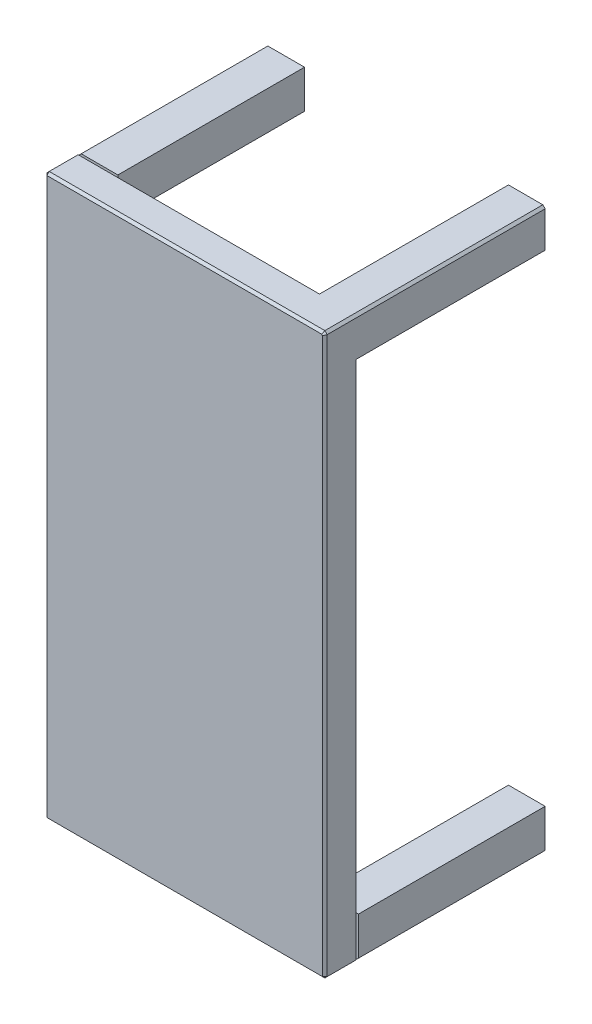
ISO-10303-21;
HEADER;
FILE_DESCRIPTION(('STEP AP214'),'2;1');
FILE_NAME('part.step','',(''),(''),'','','');
FILE_SCHEMA(('AUTOMOTIVE_DESIGN { 1 0 10303 214 1 1 1 1 }'));
ENDSEC;
DATA;
#1=APPLICATION_CONTEXT('core data for automotive mechanical design processes');
#2=APPLICATION_PROTOCOL_DEFINITION('international standard','automotive_design',2000,#1);
#3=PRODUCT_CONTEXT('',#1,'mechanical');
#4=PRODUCT('Part','Part','',(#3));
#5=PRODUCT_RELATED_PRODUCT_CATEGORY('part','',(#4));
#6=PRODUCT_DEFINITION_FORMATION('','',#4);
#7=PRODUCT_DEFINITION_CONTEXT('part definition',#1,'design');
#8=PRODUCT_DEFINITION('design','',#6,#7);
#9=PRODUCT_DEFINITION_SHAPE('','',#8);
#10=(LENGTH_UNIT() NAMED_UNIT(*) SI_UNIT(.MILLI.,.METRE.));
#11=(NAMED_UNIT(*) PLANE_ANGLE_UNIT() SI_UNIT($,.RADIAN.));
#12=(NAMED_UNIT(*) SI_UNIT($,.STERADIAN.) SOLID_ANGLE_UNIT());
#13=UNCERTAINTY_MEASURE_WITH_UNIT(LENGTH_MEASURE(1.E-05),#10,'distance_accuracy_value','');
#14=(GEOMETRIC_REPRESENTATION_CONTEXT(3) GLOBAL_UNCERTAINTY_ASSIGNED_CONTEXT((#13)) GLOBAL_UNIT_ASSIGNED_CONTEXT((#10,
#11,#12)) REPRESENTATION_CONTEXT('',''));
#15=CARTESIAN_POINT('',(0.,0.,0.));
#16=DIRECTION('',(0.,0.,1.));
#17=DIRECTION('',(1.,0.,0.));
#18=AXIS2_PLACEMENT_3D('',#15,#16,#17);
#19=CARTESIAN_POINT('',(0.,0.,0.));
#20=DIRECTION('',(0.,0.,-1.));
#21=DIRECTION('',(-1.,0.,0.));
#22=AXIS2_PLACEMENT_3D('',#19,#20,#21);
#23=PLANE('',#22);
#24=DIRECTION('',(1.,0.,0.));
#25=VECTOR('',#24,1.);
#26=CARTESIAN_POINT('',(0.,-609.6,0.));
#27=LINE('',#26,#25);
#28=CARTESIAN_POINT('',(-302.26,-609.6,0.));
#29=VERTEX_POINT('',#28);
#30=CARTESIAN_POINT('',(-2.53999999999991,-609.6,0.));
#31=VERTEX_POINT('',#30);
#32=EDGE_CURVE('E622',#29,#31,#27,.T.);
#33=ORIENTED_EDGE('',*,*,#32,.F.);
#34=DIRECTION('',(0.707106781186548,-0.707106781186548,0.));
#35=VECTOR('',#34,1.);
#36=CARTESIAN_POINT('',(-455.93,-455.93,0.));
#37=LINE('',#36,#35);
#38=CARTESIAN_POINT('',(-304.8,-607.06,0.));
#39=VERTEX_POINT('',#38);
#40=EDGE_CURVE('E543',#29,#39,#37,.F.);
#41=ORIENTED_EDGE('',*,*,#40,.T.);
#42=DIRECTION('',(0.,-1.,0.));
#43=VECTOR('',#42,1.);
#44=CARTESIAN_POINT('',(-304.8,0.,0.));
#45=LINE('',#44,#43);
#46=CARTESIAN_POINT('',(-304.8,-6.13210244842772,0.));
#47=VERTEX_POINT('',#46);
#48=EDGE_CURVE('E397',#47,#39,#45,.T.);
#49=ORIENTED_EDGE('',*,*,#48,.F.);
#50=DIRECTION('',(0.577350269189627,0.816496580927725,0.));
#51=VECTOR('',#50,1.);
#52=CARTESIAN_POINT('',(-200.309299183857,141.640063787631,0.));
#53=LINE('',#52,#51);
#54=CARTESIAN_POINT('',(-304.047597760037,-5.06804499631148,0.));
#55=VERTEX_POINT('',#54);
#56=EDGE_CURVE('E540',#47,#55,#53,.T.);
#57=ORIENTED_EDGE('',*,*,#56,.T.);
#58=DIRECTION('',(0.,1.,0.));
#59=VECTOR('',#58,1.);
#60=CARTESIAN_POINT('',(-304.047597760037,0.,0.));
#61=LINE('',#60,#59);
#62=CARTESIAN_POINT('',(-304.047597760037,-41.5560271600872,0.));
#63=VERTEX_POINT('',#62);
#64=EDGE_CURVE('E377',#63,#55,#61,.T.);
#65=ORIENTED_EDGE('',*,*,#64,.F.);
#66=DIRECTION('',(-0.707106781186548,0.707106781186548,0.));
#67=VECTOR('',#66,1.);
#68=CARTESIAN_POINT('',(-304.047597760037,-41.5560271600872,0.));
#69=LINE('',#68,#67);
#70=CARTESIAN_POINT('',(-301.507597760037,-44.0960271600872,0.));
#71=VERTEX_POINT('',#70);
#72=EDGE_CURVE('E497',#63,#71,#69,.F.);
#73=ORIENTED_EDGE('',*,*,#72,.T.);
#74=DIRECTION('',(-1.,0.,0.));
#75=VECTOR('',#74,1.);
#76=CARTESIAN_POINT('',(-261.62,-44.0960271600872,0.));
#77=LINE('',#76,#75);
#78=CARTESIAN_POINT('',(-264.16,-44.0960271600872,0.));
#79=VERTEX_POINT('',#78);
#80=EDGE_CURVE('E373',#79,#71,#77,.T.);
#81=ORIENTED_EDGE('',*,*,#80,.F.);
#82=DIRECTION('',(-0.707106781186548,-0.707106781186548,0.));
#83=VECTOR('',#82,1.);
#84=CARTESIAN_POINT('',(-264.16,-44.0960271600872,0.));
#85=LINE('',#84,#83);
#86=CARTESIAN_POINT('',(-261.62,-41.5560271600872,0.));
#87=VERTEX_POINT('',#86);
#88=EDGE_CURVE('E495',#79,#87,#85,.F.);
#89=ORIENTED_EDGE('',*,*,#88,.T.);
#90=DIRECTION('',(0.,-1.,0.));
#91=VECTOR('',#90,1.);
#92=CARTESIAN_POINT('',(-261.62,0.,0.));
#93=LINE('',#92,#91);
#94=CARTESIAN_POINT('',(-261.62,-2.54000000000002,0.));
#95=VERTEX_POINT('',#94);
#96=EDGE_CURVE('E356',#95,#87,#93,.T.);
#97=ORIENTED_EDGE('',*,*,#96,.F.);
#98=DIRECTION('',(1.,0.,0.));
#99=VECTOR('',#98,1.);
#100=CARTESIAN_POINT('',(-42.4275977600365,-2.53999999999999,0.));
#101=LINE('',#100,#99);
#102=CARTESIAN_POINT('',(-42.4275977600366,-2.53999999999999,0.));
#103=VERTEX_POINT('',#102);
#104=EDGE_CURVE('E438',#95,#103,#101,.T.);
#105=ORIENTED_EDGE('',*,*,#104,.T.);
#106=DIRECTION('',(0.,1.,0.));
#107=VECTOR('',#106,1.);
#108=CARTESIAN_POINT('',(-42.4275977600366,0.,0.));
#109=LINE('',#108,#107);
#110=CARTESIAN_POINT('',(-42.4275977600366,-41.5560271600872,0.));
#111=VERTEX_POINT('',#110);
#112=EDGE_CURVE('E388',#111,#103,#109,.T.);
#113=ORIENTED_EDGE('',*,*,#112,.F.);
#114=DIRECTION('',(-0.707106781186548,0.707106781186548,0.));
#115=VECTOR('',#114,1.);
#116=CARTESIAN_POINT('',(-42.4275977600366,-41.5560271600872,0.));
#117=LINE('',#116,#115);
#118=CARTESIAN_POINT('',(-39.8875977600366,-44.0960271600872,0.));
#119=VERTEX_POINT('',#118);
#120=EDGE_CURVE('E441',#111,#119,#117,.F.);
#121=ORIENTED_EDGE('',*,*,#120,.T.);
#122=DIRECTION('',(-1.,0.,0.));
#123=VECTOR('',#122,1.);
#124=CARTESIAN_POINT('',(0.,-44.0960271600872,0.));
#125=LINE('',#124,#123);
#126=CARTESIAN_POINT('',(-2.53999999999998,-44.0960271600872,0.));
#127=VERTEX_POINT('',#126);
#128=EDGE_CURVE('E405',#127,#119,#125,.T.);
#129=ORIENTED_EDGE('',*,*,#128,.F.);
#130=DIRECTION('',(0.,-1.,0.));
#131=VECTOR('',#130,1.);
#132=CARTESIAN_POINT('',(-2.53999999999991,-609.6,0.));
#133=LINE('',#132,#131);
#134=CARTESIAN_POINT('',(-2.53999999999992,-565.15,0.));
#135=VERTEX_POINT('',#134);
#136=EDGE_CURVE('E406',#127,#135,#133,.T.);
#137=ORIENTED_EDGE('',*,*,#136,.T.);
#138=DIRECTION('',(1.,0.,0.));
#139=VECTOR('',#138,1.);
#140=CARTESIAN_POINT('',(0.,-565.15,0.));
#141=LINE('',#140,#139);
#142=CARTESIAN_POINT('',(-39.8875977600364,-565.15,0.));
#143=VERTEX_POINT('',#142);
#144=EDGE_CURVE('E335',#143,#135,#141,.T.);
#145=ORIENTED_EDGE('',*,*,#144,.F.);
#146=DIRECTION('',(0.707106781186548,0.707106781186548,0.));
#147=VECTOR('',#146,1.);
#148=CARTESIAN_POINT('',(-39.8875977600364,-565.15,0.));
#149=LINE('',#148,#147);
#150=CARTESIAN_POINT('',(-42.4275977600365,-567.69,0.));
#151=VERTEX_POINT('',#150);
#152=EDGE_CURVE('E524',#143,#151,#149,.F.);
#153=ORIENTED_EDGE('',*,*,#152,.T.);
#154=DIRECTION('',(0.,1.,0.));
#155=VECTOR('',#154,1.);
#156=CARTESIAN_POINT('',(-42.4275977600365,-565.15,0.));
#157=LINE('',#156,#155);
#158=CARTESIAN_POINT('',(-42.4275977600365,-606.706027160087,0.));
#159=VERTEX_POINT('',#158);
#160=EDGE_CURVE('E349',#159,#151,#157,.T.);
#161=ORIENTED_EDGE('',*,*,#160,.F.);
#162=DIRECTION('',(-0.707106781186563,0.707106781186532,0.));
#163=VECTOR('',#162,1.);
#164=CARTESIAN_POINT('',(-42.4275977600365,-606.706027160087,0.));
#165=LINE('',#164,#163);
#166=CARTESIAN_POINT('',(-39.8875977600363,-609.246027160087,0.));
#167=VERTEX_POINT('',#166);
#168=EDGE_CURVE('E522',#159,#167,#165,.F.);
#169=ORIENTED_EDGE('',*,*,#168,.T.);
#170=DIRECTION('',(-1.,0.,0.));
#171=VECTOR('',#170,1.);
#172=CARTESIAN_POINT('',(0.,-609.246027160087,0.));
#173=LINE('',#172,#171);
#174=CARTESIAN_POINT('',(-2.5399999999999,-609.246027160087,0.));
#175=VERTEX_POINT('',#174);
#176=EDGE_CURVE('E346',#175,#167,#173,.T.);
#177=ORIENTED_EDGE('',*,*,#176,.F.);
#178=EDGE_CURVE('E625',#175,#31,#133,.T.);
#179=ORIENTED_EDGE('',*,*,#178,.T.);
#180=EDGE_LOOP('',(#33,#41,#49,#57,#65,#73,#81,#89,#97,#105,#113,#121,#129,#137,#145,#153,#161,
#169,#177,#179));
#181=FACE_BOUND('',#180,.T.);
#182=DIRECTION('',(-1.,0.,0.));
#183=VECTOR('',#182,1.);
#184=CARTESIAN_POINT('',(-261.62,-609.246027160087,0.));
#185=LINE('',#184,#183);
#186=CARTESIAN_POINT('',(-264.16,-609.246027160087,0.));
#187=VERTEX_POINT('',#186);
#188=CARTESIAN_POINT('',(-301.507597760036,-609.246027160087,0.));
#189=VERTEX_POINT('',#188);
#190=EDGE_CURVE('E326',#187,#189,#185,.T.);
#191=ORIENTED_EDGE('',*,*,#190,.F.);
#192=DIRECTION('',(-0.707106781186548,-0.707106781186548,0.));
#193=VECTOR('',#192,1.);
#194=CARTESIAN_POINT('',(-264.16,-609.246027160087,0.));
#195=LINE('',#194,#193);
#196=CARTESIAN_POINT('',(-261.62,-606.706027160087,0.));
#197=VERTEX_POINT('',#196);
#198=EDGE_CURVE('E465',#187,#197,#195,.F.);
#199=ORIENTED_EDGE('',*,*,#198,.T.);
#200=DIRECTION('',(0.,-1.,0.));
#201=VECTOR('',#200,1.);
#202=CARTESIAN_POINT('',(-261.62,-565.15,0.));
#203=LINE('',#202,#201);
#204=CARTESIAN_POINT('',(-261.62,-565.15,0.));
#205=VERTEX_POINT('',#204);
#206=EDGE_CURVE('E324',#205,#197,#203,.T.);
#207=ORIENTED_EDGE('',*,*,#206,.F.);
#208=DIRECTION('',(1.,0.,0.));
#209=VECTOR('',#208,1.);
#210=CARTESIAN_POINT('',(-261.62,-565.15,0.));
#211=LINE('',#210,#209);
#212=CARTESIAN_POINT('',(-301.507597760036,-565.15,0.));
#213=VERTEX_POINT('',#212);
#214=EDGE_CURVE('E307',#213,#205,#211,.T.);
#215=ORIENTED_EDGE('',*,*,#214,.F.);
#216=DIRECTION('',(0.707106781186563,0.707106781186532,0.));
#217=VECTOR('',#216,1.);
#218=CARTESIAN_POINT('',(-301.507597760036,-565.15,0.));
#219=LINE('',#218,#217);
#220=CARTESIAN_POINT('',(-304.047597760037,-567.69,0.));
#221=VERTEX_POINT('',#220);
#222=EDGE_CURVE('E467',#213,#221,#219,.F.);
#223=ORIENTED_EDGE('',*,*,#222,.T.);
#224=DIRECTION('',(0.,1.,0.));
#225=VECTOR('',#224,1.);
#226=CARTESIAN_POINT('',(-304.047597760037,-565.15,0.));
#227=LINE('',#226,#225);
#228=CARTESIAN_POINT('',(-304.047597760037,-606.706027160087,0.));
#229=VERTEX_POINT('',#228);
#230=EDGE_CURVE('E320',#229,#221,#227,.T.);
#231=ORIENTED_EDGE('',*,*,#230,.F.);
#232=DIRECTION('',(-0.707106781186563,0.707106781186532,0.));
#233=VECTOR('',#232,1.);
#234=CARTESIAN_POINT('',(-304.047597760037,-606.706027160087,0.));
#235=LINE('',#234,#233);
#236=EDGE_CURVE('E469',#229,#189,#235,.F.);
#237=ORIENTED_EDGE('',*,*,#236,.T.);
#238=EDGE_LOOP('',(#191,#199,#207,#215,#223,#231,#237));
#239=FACE_BOUND('',#238,.T.);
#240=ADVANCED_FACE('F31',(#181,#239),#23,.T.);
#241=CARTESIAN_POINT('',(0.,0.,36.576));
#242=DIRECTION('',(-1.,0.,0.));
#243=DIRECTION('',(0.,-1.,0.));
#244=AXIS2_PLACEMENT_3D('',#241,#242,#243);
#245=PLANE('',#244);
#246=DIRECTION('',(0.,-1.,0.));
#247=VECTOR('',#246,1.);
#248=CARTESIAN_POINT('',(0.,0.,34.0359999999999));
#249=LINE('',#248,#247);
#250=CARTESIAN_POINT('',(0.,-2.5400000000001,34.0359999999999));
#251=VERTEX_POINT('',#250);
#252=CARTESIAN_POINT('',(0.,-607.06,34.0359999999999));
#253=VERTEX_POINT('',#252);
#254=EDGE_CURVE('E526',#251,#253,#249,.T.);
#255=ORIENTED_EDGE('',*,*,#254,.T.);
#256=DIRECTION('',(0.,0.,-1.));
#257=VECTOR('',#256,1.);
#258=CARTESIAN_POINT('',(0.,-607.06,36.576));
#259=LINE('',#258,#257);
#260=CARTESIAN_POINT('',(0.,-607.06,2.53999999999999));
#261=VERTEX_POINT('',#260);
#262=EDGE_CURVE('E528',#253,#261,#259,.T.);
#263=ORIENTED_EDGE('',*,*,#262,.T.);
#264=DIRECTION('',(0.,1.,0.));
#265=VECTOR('',#264,1.);
#266=CARTESIAN_POINT('',(0.,-44.0960271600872,2.53999999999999));
#267=LINE('',#266,#265);
#268=CARTESIAN_POINT('',(0.,-41.5560271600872,2.53999999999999));
#269=VERTEX_POINT('',#268);
#270=EDGE_CURVE('E623',#261,#269,#267,.T.);
#271=ORIENTED_EDGE('',*,*,#270,.T.);
#272=DIRECTION('',(0.,0.,-1.));
#273=VECTOR('',#272,1.);
#274=CARTESIAN_POINT('',(0.,-41.5560271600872,36.576));
#275=LINE('',#274,#273);
#276=CARTESIAN_POINT('',(0.,-41.5560271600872,-202.946));
#277=VERTEX_POINT('',#276);
#278=EDGE_CURVE('E429',#269,#277,#275,.T.);
#279=ORIENTED_EDGE('',*,*,#278,.T.);
#280=DIRECTION('',(0.,-1.,0.));
#281=VECTOR('',#280,1.);
#282=CARTESIAN_POINT('',(0.,0.,-202.946));
#283=LINE('',#282,#281);
#284=CARTESIAN_POINT('',(0.,-2.5400000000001,-202.946));
#285=VERTEX_POINT('',#284);
#286=EDGE_CURVE('E384',#285,#277,#283,.T.);
#287=ORIENTED_EDGE('',*,*,#286,.F.);
#288=DIRECTION('',(0.,0.,1.));
#289=VECTOR('',#288,1.);
#290=CARTESIAN_POINT('',(0.,-2.5400000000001,36.576));
#291=LINE('',#290,#289);
#292=EDGE_CURVE('E426',#285,#251,#291,.T.);
#293=ORIENTED_EDGE('',*,*,#292,.T.);
#294=EDGE_LOOP('',(#255,#263,#271,#279,#287,#293));
#295=FACE_BOUND('',#294,.T.);
#296=ADVANCED_FACE('F668',(#295),#245,.F.);
#297=CARTESIAN_POINT('',(0.,0.,36.576));
#298=DIRECTION('',(0.,-1.,0.));
#299=DIRECTION('',(1.,0.,0.));
#300=AXIS2_PLACEMENT_3D('',#297,#298,#299);
#301=PLANE('',#300);
#302=DIRECTION('',(0.,0.,1.));
#303=VECTOR('',#302,1.);
#304=CARTESIAN_POINT('',(-302.26,0.,36.576));
#305=LINE('',#304,#303);
#306=CARTESIAN_POINT('',(-302.26,0.,2.53999999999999));
#307=VERTEX_POINT('',#306);
#308=CARTESIAN_POINT('',(-302.26,0.,34.0359999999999));
#309=VERTEX_POINT('',#308);
#310=EDGE_CURVE('E54',#307,#309,#305,.T.);
#311=ORIENTED_EDGE('',*,*,#310,.T.);
#312=DIRECTION('',(1.,0.,0.));
#313=VECTOR('',#312,1.);
#314=CARTESIAN_POINT('',(0.,0.,34.0359999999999));
#315=LINE('',#314,#313);
#316=CARTESIAN_POINT('',(-2.5400000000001,0.,34.0359999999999));
#317=VERTEX_POINT('',#316);
#318=EDGE_CURVE('E567',#309,#317,#315,.T.);
#319=ORIENTED_EDGE('',*,*,#318,.T.);
#320=DIRECTION('',(0.,0.,-1.));
#321=VECTOR('',#320,1.);
#322=CARTESIAN_POINT('',(-2.5400000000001,0.,36.576));
#323=LINE('',#322,#321);
#324=CARTESIAN_POINT('',(-2.54000000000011,0.,-202.946));
#325=VERTEX_POINT('',#324);
#326=EDGE_CURVE('E436',#317,#325,#323,.T.);
#327=ORIENTED_EDGE('',*,*,#326,.T.);
#328=DIRECTION('',(1.,0.,0.));
#329=VECTOR('',#328,1.);
#330=CARTESIAN_POINT('',(0.,0.,-202.946));
#331=LINE('',#330,#329);
#332=CARTESIAN_POINT('',(-39.8875977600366,0.,-202.946));
#333=VERTEX_POINT('',#332);
#334=EDGE_CURVE('E394',#333,#325,#331,.T.);
#335=ORIENTED_EDGE('',*,*,#334,.F.);
#336=DIRECTION('',(0.,0.,1.));
#337=VECTOR('',#336,1.);
#338=CARTESIAN_POINT('',(-39.8875977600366,0.,36.576));
#339=LINE('',#338,#337);
#340=CARTESIAN_POINT('',(-39.8875977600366,0.,2.53999999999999));
#341=VERTEX_POINT('',#340);
#342=EDGE_CURVE('E433',#333,#341,#339,.T.);
#343=ORIENTED_EDGE('',*,*,#342,.T.);
#344=DIRECTION('',(-1.,0.,0.));
#345=VECTOR('',#344,1.);
#346=CARTESIAN_POINT('',(-304.8,0.,2.53999999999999));
#347=LINE('',#346,#345);
#348=EDGE_CURVE('E431',#341,#307,#347,.T.);
#349=ORIENTED_EDGE('',*,*,#348,.T.);
#350=EDGE_LOOP('',(#311,#319,#327,#335,#343,#349));
#351=FACE_BOUND('',#350,.T.);
#352=ADVANCED_FACE('F660',(#351),#301,.F.);
#353=CARTESIAN_POINT('',(-304.8,0.,36.576));
#354=DIRECTION('',(1.,0.,0.));
#355=DIRECTION('',(0.,1.,0.));
#356=AXIS2_PLACEMENT_3D('',#353,#354,#355);
#357=PLANE('',#356);
#358=ORIENTED_EDGE('',*,*,#48,.T.);
#359=DIRECTION('',(0.,0.,1.));
#360=VECTOR('',#359,1.);
#361=CARTESIAN_POINT('',(-304.8,-607.06,36.576));
#362=LINE('',#361,#360);
#363=CARTESIAN_POINT('',(-304.8,-607.06,34.0359999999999));
#364=VERTEX_POINT('',#363);
#365=EDGE_CURVE('E551',#39,#364,#362,.T.);
#366=ORIENTED_EDGE('',*,*,#365,.T.);
#367=DIRECTION('',(0.,1.,0.));
#368=VECTOR('',#367,1.);
#369=CARTESIAN_POINT('',(-304.8,0.,34.0359999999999));
#370=LINE('',#369,#368);
#371=CARTESIAN_POINT('',(-304.8,-2.54000000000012,34.0359999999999));
#372=VERTEX_POINT('',#371);
#373=EDGE_CURVE('E549',#364,#372,#370,.T.);
#374=ORIENTED_EDGE('',*,*,#373,.T.);
#375=DIRECTION('',(0.,0.,-1.));
#376=VECTOR('',#375,1.);
#377=CARTESIAN_POINT('',(-304.8,-2.54000000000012,36.576));
#378=LINE('',#377,#376);
#379=CARTESIAN_POINT('',(-304.8,-2.54000000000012,3.59210244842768));
#380=VERTEX_POINT('',#379);
#381=EDGE_CURVE('E547',#372,#380,#378,.T.);
#382=ORIENTED_EDGE('',*,*,#381,.T.);
#383=DIRECTION('',(0.,-0.707106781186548,-0.707106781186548));
#384=VECTOR('',#383,1.);
#385=CARTESIAN_POINT('',(-304.8,-4.33605122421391,1.79605122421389));
#386=LINE('',#385,#384);
#387=EDGE_CURVE('E545',#380,#47,#386,.T.);
#388=ORIENTED_EDGE('',*,*,#387,.T.);
#389=EDGE_LOOP('',(#358,#366,#374,#382,#388));
#390=FACE_BOUND('',#389,.T.);
#391=ADVANCED_FACE('F615',(#390),#357,.F.);
#392=CARTESIAN_POINT('',(0.,-609.6,36.576));
#393=DIRECTION('',(0.,1.,0.));
#394=DIRECTION('',(0.,0.,1.));
#395=AXIS2_PLACEMENT_3D('',#392,#393,#394);
#396=PLANE('',#395);
#397=ORIENTED_EDGE('',*,*,#32,.T.);
#398=DIRECTION('',(0.,0.,1.));
#399=VECTOR('',#398,1.);
#400=CARTESIAN_POINT('',(-2.54000000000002,-609.6,36.576));
#401=LINE('',#400,#399);
#402=CARTESIAN_POINT('',(-2.54000000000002,-609.6,34.0359999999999));
#403=VERTEX_POINT('',#402);
#404=EDGE_CURVE('E538',#31,#403,#401,.T.);
#405=ORIENTED_EDGE('',*,*,#404,.T.);
#406=DIRECTION('',(-1.,0.,0.));
#407=VECTOR('',#406,1.);
#408=CARTESIAN_POINT('',(0.,-609.6,34.0359999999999));
#409=LINE('',#408,#407);
#410=CARTESIAN_POINT('',(-302.26,-609.6,34.0359999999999));
#411=VERTEX_POINT('',#410);
#412=EDGE_CURVE('E534',#403,#411,#409,.T.);
#413=ORIENTED_EDGE('',*,*,#412,.T.);
#414=DIRECTION('',(0.,0.,-1.));
#415=VECTOR('',#414,1.);
#416=CARTESIAN_POINT('',(-302.26,-609.6,36.576));
#417=LINE('',#416,#415);
#418=EDGE_CURVE('E536',#411,#29,#417,.T.);
#419=ORIENTED_EDGE('',*,*,#418,.T.);
#420=EDGE_LOOP('',(#397,#405,#413,#419));
#421=FACE_BOUND('',#420,.T.);
#422=ADVANCED_FACE('F711',(#421),#396,.F.);
#423=CARTESIAN_POINT('',(0.,0.,36.576));
#424=DIRECTION('',(0.,0.,-1.));
#425=DIRECTION('',(-1.,0.,0.));
#426=AXIS2_PLACEMENT_3D('',#423,#424,#425);
#427=PLANE('',#426);
#428=DIRECTION('',(1.,0.,0.));
#429=VECTOR('',#428,1.);
#430=CARTESIAN_POINT('',(0.,-607.06,36.576));
#431=LINE('',#430,#429);
#432=CARTESIAN_POINT('',(-302.26,-607.06,36.576));
#433=VERTEX_POINT('',#432);
#434=CARTESIAN_POINT('',(-2.54000000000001,-607.06,36.576));
#435=VERTEX_POINT('',#434);
#436=EDGE_CURVE('E559',#433,#435,#431,.T.);
#437=ORIENTED_EDGE('',*,*,#436,.T.);
#438=DIRECTION('',(0.,1.,0.));
#439=VECTOR('',#438,1.);
#440=CARTESIAN_POINT('',(-2.54000000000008,0.,36.576));
#441=LINE('',#440,#439);
#442=CARTESIAN_POINT('',(-2.54000000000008,-3.5921024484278,36.576));
#443=VERTEX_POINT('',#442);
#444=EDGE_CURVE('E561',#435,#443,#441,.T.);
#445=ORIENTED_EDGE('',*,*,#444,.T.);
#446=DIRECTION('',(-0.707106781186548,0.707106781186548,0.));
#447=VECTOR('',#446,1.);
#448=CARTESIAN_POINT('',(-4.33605122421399,-1.79605122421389,36.576));
#449=LINE('',#448,#447);
#450=CARTESIAN_POINT('',(-3.59210244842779,-2.54000000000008,36.576));
#451=VERTEX_POINT('',#450);
#452=EDGE_CURVE('E557',#443,#451,#449,.T.);
#453=ORIENTED_EDGE('',*,*,#452,.T.);
#454=DIRECTION('',(-1.,0.,0.));
#455=VECTOR('',#454,1.);
#456=CARTESIAN_POINT('',(0.,-2.54000000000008,36.576));
#457=LINE('',#456,#455);
#458=CARTESIAN_POINT('',(-302.26,-2.54000000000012,36.576));
#459=VERTEX_POINT('',#458);
#460=EDGE_CURVE('E555',#451,#459,#457,.T.);
#461=ORIENTED_EDGE('',*,*,#460,.T.);
#462=DIRECTION('',(0.,-1.,0.));
#463=VECTOR('',#462,1.);
#464=CARTESIAN_POINT('',(-302.26,0.,36.576));
#465=LINE('',#464,#463);
#466=EDGE_CURVE('E553',#459,#433,#465,.T.);
#467=ORIENTED_EDGE('',*,*,#466,.T.);
#468=EDGE_LOOP('',(#437,#445,#453,#461,#467));
#469=FACE_BOUND('',#468,.T.);
#470=ADVANCED_FACE('F709',(#469),#427,.F.);
#471=CARTESIAN_POINT('',(0.,-44.0960271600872,-202.946));
#472=DIRECTION('',(0.,1.,0.));
#473=DIRECTION('',(0.,0.,1.));
#474=AXIS2_PLACEMENT_3D('',#471,#472,#473);
#475=PLANE('',#474);
#476=ORIENTED_EDGE('',*,*,#128,.T.);
#477=DIRECTION('',(0.,0.,-1.));
#478=VECTOR('',#477,1.);
#479=CARTESIAN_POINT('',(-39.8875977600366,-44.0960271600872,-202.946));
#480=LINE('',#479,#478);
#481=CARTESIAN_POINT('',(-39.8875977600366,-44.0960271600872,-202.946));
#482=VERTEX_POINT('',#481);
#483=EDGE_CURVE('E416',#119,#482,#480,.T.);
#484=ORIENTED_EDGE('',*,*,#483,.T.);
#485=DIRECTION('',(-1.,0.,0.));
#486=VECTOR('',#485,1.);
#487=CARTESIAN_POINT('',(0.,-44.0960271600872,-202.946));
#488=LINE('',#487,#486);
#489=CARTESIAN_POINT('',(-2.5400000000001,-44.0960271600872,-202.946));
#490=VERTEX_POINT('',#489);
#491=EDGE_CURVE('E387',#490,#482,#488,.T.);
#492=ORIENTED_EDGE('',*,*,#491,.F.);
#493=DIRECTION('',(0.,0.,1.));
#494=VECTOR('',#493,1.);
#495=CARTESIAN_POINT('',(-2.54000000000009,-44.0960271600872,-202.946));
#496=LINE('',#495,#494);
#497=EDGE_CURVE('E413',#490,#127,#496,.T.);
#498=ORIENTED_EDGE('',*,*,#497,.T.);
#499=EDGE_LOOP('',(#476,#484,#492,#498));
#500=FACE_BOUND('',#499,.T.);
#501=ADVANCED_FACE('F633',(#500),#475,.F.);
#502=CARTESIAN_POINT('',(-42.4275977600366,0.,-202.946));
#503=DIRECTION('',(1.,0.,0.));
#504=DIRECTION('',(0.,0.,-1.));
#505=AXIS2_PLACEMENT_3D('',#502,#503,#504);
#506=PLANE('',#505);
#507=DIRECTION('',(0.,1.,0.));
#508=VECTOR('',#507,1.);
#509=CARTESIAN_POINT('',(-42.4275977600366,0.,-202.946));
#510=LINE('',#509,#508);
#511=CARTESIAN_POINT('',(-42.4275977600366,-41.5560271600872,-202.946));
#512=VERTEX_POINT('',#511);
#513=CARTESIAN_POINT('',(-42.4275977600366,-2.54,-202.946));
#514=VERTEX_POINT('',#513);
#515=EDGE_CURVE('E391',#512,#514,#510,.T.);
#516=ORIENTED_EDGE('',*,*,#515,.F.);
#517=DIRECTION('',(0.,0.,1.));
#518=VECTOR('',#517,1.);
#519=CARTESIAN_POINT('',(-42.4275977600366,-41.5560271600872,-202.946));
#520=LINE('',#519,#518);
#521=EDGE_CURVE('E410',#512,#111,#520,.T.);
#522=ORIENTED_EDGE('',*,*,#521,.T.);
#523=ORIENTED_EDGE('',*,*,#112,.T.);
#524=DIRECTION('',(0.,0.,-1.));
#525=VECTOR('',#524,1.);
#526=CARTESIAN_POINT('',(-42.4275977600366,-2.53999999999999,-202.946));
#527=LINE('',#526,#525);
#528=EDGE_CURVE('E408',#103,#514,#527,.T.);
#529=ORIENTED_EDGE('',*,*,#528,.T.);
#530=EDGE_LOOP('',(#516,#522,#523,#529));
#531=FACE_BOUND('',#530,.T.);
#532=ADVANCED_FACE('F647',(#531),#506,.F.);
#533=CARTESIAN_POINT('',(0.,-44.0960271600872,-202.946));
#534=DIRECTION('',(0.,0.,-1.));
#535=DIRECTION('',(-1.,0.,0.));
#536=AXIS2_PLACEMENT_3D('',#533,#534,#535);
#537=PLANE('',#536);
#538=ORIENTED_EDGE('',*,*,#491,.T.);
#539=DIRECTION('',(0.707106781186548,-0.707106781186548,0.));
#540=VECTOR('',#539,1.);
#541=CARTESIAN_POINT('',(-19.9437988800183,-64.0398260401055,-202.946));
#542=LINE('',#541,#540);
#543=EDGE_CURVE('E424',#482,#512,#542,.F.);
#544=ORIENTED_EDGE('',*,*,#543,.T.);
#545=ORIENTED_EDGE('',*,*,#515,.T.);
#546=DIRECTION('',(-0.707106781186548,-0.707106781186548,0.));
#547=VECTOR('',#546,1.);
#548=CARTESIAN_POINT('',(-41.9918124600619,-2.10421470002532,-202.946));
#549=LINE('',#548,#547);
#550=EDGE_CURVE('E418',#514,#333,#549,.F.);
#551=ORIENTED_EDGE('',*,*,#550,.T.);
#552=ORIENTED_EDGE('',*,*,#334,.T.);
#553=DIRECTION('',(-0.707106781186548,0.707106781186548,0.));
#554=VECTOR('',#553,1.);
#555=CARTESIAN_POINT('',(20.7780135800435,-23.3180135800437,-202.946));
#556=LINE('',#555,#554);
#557=EDGE_CURVE('E420',#325,#285,#556,.F.);
#558=ORIENTED_EDGE('',*,*,#557,.T.);
#559=ORIENTED_EDGE('',*,*,#286,.T.);
#560=DIRECTION('',(0.707106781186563,0.707106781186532,0.));
#561=VECTOR('',#560,1.);
#562=CARTESIAN_POINT('',(-1.26999999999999,-42.8260271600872,-202.946));
#563=LINE('',#562,#561);
#564=EDGE_CURVE('E422',#277,#490,#563,.F.);
#565=ORIENTED_EDGE('',*,*,#564,.T.);
#566=EDGE_LOOP('',(#538,#544,#545,#551,#552,#558,#559,#565));
#567=FACE_BOUND('',#566,.T.);
#568=ADVANCED_FACE('F644',(#567),#537,.T.);
#569=CARTESIAN_POINT('',(0.,0.,2.53999999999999));
#570=DIRECTION('',(0.707106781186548,0.,-0.707106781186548));
#571=DIRECTION('',(-0.707106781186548,0.,-0.707106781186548));
#572=AXIS2_PLACEMENT_3D('',#569,#570,#571);
#573=PLANE('',#572);
#574=ORIENTED_EDGE('',*,*,#270,.F.);
#575=DIRECTION('',(0.577350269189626,0.577350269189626,0.577350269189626));
#576=VECTOR('',#575,1.);
#577=CARTESIAN_POINT('',(202.353333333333,-404.706666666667,204.893333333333));
#578=LINE('',#577,#576);
#579=EDGE_CURVE('E531',#261,#31,#578,.F.);
#580=ORIENTED_EDGE('',*,*,#579,.T.);
#581=ORIENTED_EDGE('',*,*,#178,.F.);
#582=EDGE_CURVE('E1230',#135,#175,#133,.T.);
#583=ORIENTED_EDGE('',*,*,#582,.F.);
#584=ORIENTED_EDGE('',*,*,#136,.F.);
#585=DIRECTION('',(-0.577350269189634,-0.577350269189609,-0.577350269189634));
#586=VECTOR('',#585,1.);
#587=CARTESIAN_POINT('',(-70.1886666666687,-111.744693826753,-67.6486666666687));
#588=LINE('',#587,#586);
#589=EDGE_CURVE('E443',#127,#269,#588,.F.);
#590=ORIENTED_EDGE('',*,*,#589,.T.);
#591=EDGE_LOOP('',(#574,#580,#581,#583,#584,#590));
#592=FACE_BOUND('',#591,.T.);
#593=ADVANCED_FACE('F687',(#592),#573,.T.);
#594=CARTESIAN_POINT('',(-42.4275977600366,-41.5560271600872,-202.946));
#595=DIRECTION('',(0.707106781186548,0.707106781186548,0.));
#596=DIRECTION('',(-0.707106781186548,0.707106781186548,0.));
#597=AXIS2_PLACEMENT_3D('',#594,#595,#596);
#598=PLANE('',#597);
#599=ORIENTED_EDGE('',*,*,#543,.F.);
#600=ORIENTED_EDGE('',*,*,#483,.F.);
#601=ORIENTED_EDGE('',*,*,#120,.F.);
#602=ORIENTED_EDGE('',*,*,#521,.F.);
#603=EDGE_LOOP('',(#599,#600,#601,#602));
#604=FACE_BOUND('',#603,.T.);
#605=ADVANCED_FACE('F640',(#604),#598,.F.);
#606=CARTESIAN_POINT('',(-2.54000000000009,-44.0960271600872,-202.946));
#607=DIRECTION('',(-0.707106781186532,0.707106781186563,0.));
#608=DIRECTION('',(-0.707106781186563,-0.707106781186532,0.));
#609=AXIS2_PLACEMENT_3D('',#606,#607,#608);
#610=PLANE('',#609);
#611=ORIENTED_EDGE('',*,*,#564,.F.);
#612=ORIENTED_EDGE('',*,*,#278,.F.);
#613=ORIENTED_EDGE('',*,*,#589,.F.);
#614=ORIENTED_EDGE('',*,*,#497,.F.);
#615=EDGE_LOOP('',(#611,#612,#613,#614));
#616=FACE_BOUND('',#615,.T.);
#617=ADVANCED_FACE('F692',(#616),#610,.F.);
#618=CARTESIAN_POINT('',(-2.5400000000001,0.,36.576));
#619=DIRECTION('',(-0.707106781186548,-0.707106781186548,0.));
#620=DIRECTION('',(0.707106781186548,-0.707106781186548,0.));
#621=AXIS2_PLACEMENT_3D('',#618,#619,#620);
#622=PLANE('',#621);
#623=ORIENTED_EDGE('',*,*,#326,.F.);
#624=DIRECTION('',(-0.707106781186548,0.707106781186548,0.));
#625=VECTOR('',#624,1.);
#626=CARTESIAN_POINT('',(0.,-2.5400000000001,34.0359999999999));
#627=LINE('',#626,#625);
#628=EDGE_CURVE('E564',#317,#251,#627,.F.);
#629=ORIENTED_EDGE('',*,*,#628,.T.);
#630=ORIENTED_EDGE('',*,*,#292,.F.);
#631=ORIENTED_EDGE('',*,*,#557,.F.);
#632=EDGE_LOOP('',(#623,#629,#630,#631));
#633=FACE_BOUND('',#632,.T.);
#634=ADVANCED_FACE('F671',(#633),#622,.F.);
#635=CARTESIAN_POINT('',(0.,0.,2.53999999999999));
#636=DIRECTION('',(0.,0.707106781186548,-0.707106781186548));
#637=DIRECTION('',(0.,0.707106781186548,0.707106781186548));
#638=AXIS2_PLACEMENT_3D('',#635,#636,#637);
#639=PLANE('',#638);
#640=CARTESIAN_POINT('',(-302.26,-2.54000000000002,0.));
#641=VERTEX_POINT('',#640);
#642=EDGE_CURVE('E439',#641,#95,#101,.T.);
#643=ORIENTED_EDGE('',*,*,#642,.F.);
#644=DIRECTION('',(0.,0.707106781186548,0.707106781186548));
#645=VECTOR('',#644,1.);
#646=CARTESIAN_POINT('',(-302.26,0.,2.53999999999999));
#647=LINE('',#646,#645);
#648=EDGE_CURVE('E40',#641,#307,#647,.T.);
#649=ORIENTED_EDGE('',*,*,#648,.T.);
#650=ORIENTED_EDGE('',*,*,#348,.F.);
#651=DIRECTION('',(0.577350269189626,0.577350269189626,0.577350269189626));
#652=VECTOR('',#651,1.);
#653=CARTESIAN_POINT('',(-28.5422644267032,11.3453333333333,13.8853333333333));
#654=LINE('',#653,#652);
#655=EDGE_CURVE('E383',#103,#341,#654,.T.);
#656=ORIENTED_EDGE('',*,*,#655,.F.);
#657=ORIENTED_EDGE('',*,*,#104,.F.);
#658=EDGE_LOOP('',(#643,#649,#650,#656,#657));
#659=FACE_BOUND('',#658,.T.);
#660=ADVANCED_FACE('F657',(#659),#639,.T.);
#661=CARTESIAN_POINT('',(-39.8875977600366,0.,36.576));
#662=DIRECTION('',(0.707106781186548,-0.707106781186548,0.));
#663=DIRECTION('',(0.707106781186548,0.707106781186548,0.));
#664=AXIS2_PLACEMENT_3D('',#661,#662,#663);
#665=PLANE('',#664);
#666=ORIENTED_EDGE('',*,*,#550,.F.);
#667=ORIENTED_EDGE('',*,*,#528,.F.);
#668=ORIENTED_EDGE('',*,*,#655,.T.);
#669=ORIENTED_EDGE('',*,*,#342,.F.);
#670=EDGE_LOOP('',(#666,#667,#668,#669));
#671=FACE_BOUND('',#670,.T.);
#672=ADVANCED_FACE('F652',(#671),#665,.F.);
#673=CARTESIAN_POINT('',(-261.62,0.,-202.946));
#674=DIRECTION('',(-1.,0.,0.));
#675=DIRECTION('',(0.,0.,1.));
#676=AXIS2_PLACEMENT_3D('',#673,#674,#675);
#677=PLANE('',#676);
#678=ORIENTED_EDGE('',*,*,#96,.T.);
#679=DIRECTION('',(0.,0.,-1.));
#680=VECTOR('',#679,1.);
#681=CARTESIAN_POINT('',(-261.62,-41.5560271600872,-202.946));
#682=LINE('',#681,#680);
#683=CARTESIAN_POINT('',(-261.62,-41.5560271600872,-202.946));
#684=VERTEX_POINT('',#683);
#685=EDGE_CURVE('E476',#87,#684,#682,.T.);
#686=ORIENTED_EDGE('',*,*,#685,.T.);
#687=DIRECTION('',(0.,-1.,0.));
#688=VECTOR('',#687,1.);
#689=CARTESIAN_POINT('',(-261.62,0.,-202.946));
#690=LINE('',#689,#688);
#691=CARTESIAN_POINT('',(-261.62,0.,-202.946));
#692=VERTEX_POINT('',#691);
#693=EDGE_CURVE('E357',#692,#684,#690,.T.);
#694=ORIENTED_EDGE('',*,*,#693,.F.);
#695=DIRECTION('',(0.,0.,1.));
#696=VECTOR('',#695,1.);
#697=CARTESIAN_POINT('',(-261.62,0.,-202.946));
#698=LINE('',#697,#696);
#699=CARTESIAN_POINT('',(-261.62,0.,0.));
#700=VERTEX_POINT('',#699);
#701=EDGE_CURVE('E369',#692,#700,#698,.T.);
#702=ORIENTED_EDGE('',*,*,#701,.T.);
#703=EDGE_CURVE('E370',#700,#95,#93,.T.);
#704=ORIENTED_EDGE('',*,*,#703,.T.);
#705=EDGE_LOOP('',(#678,#686,#694,#702,#704));
#706=FACE_BOUND('',#705,.T.);
#707=ADVANCED_FACE('F728',(#706),#677,.F.);
#708=CARTESIAN_POINT('',(-261.62,-44.0960271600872,-202.946));
#709=DIRECTION('',(0.,1.,0.));
#710=DIRECTION('',(0.,0.,1.));
#711=AXIS2_PLACEMENT_3D('',#708,#709,#710);
#712=PLANE('',#711);
#713=DIRECTION('',(-1.,0.,0.));
#714=VECTOR('',#713,1.);
#715=CARTESIAN_POINT('',(-261.62,-44.0960271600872,-202.946));
#716=LINE('',#715,#714);
#717=CARTESIAN_POINT('',(-264.16,-44.0960271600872,-202.946));
#718=VERTEX_POINT('',#717);
#719=CARTESIAN_POINT('',(-301.507597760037,-44.0960271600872,-202.946));
#720=VERTEX_POINT('',#719);
#721=EDGE_CURVE('E360',#718,#720,#716,.T.);
#722=ORIENTED_EDGE('',*,*,#721,.F.);
#723=DIRECTION('',(0.,0.,1.));
#724=VECTOR('',#723,1.);
#725=CARTESIAN_POINT('',(-264.16,-44.0960271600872,-202.946));
#726=LINE('',#725,#724);
#727=EDGE_CURVE('E473',#718,#79,#726,.T.);
#728=ORIENTED_EDGE('',*,*,#727,.T.);
#729=ORIENTED_EDGE('',*,*,#80,.T.);
#730=DIRECTION('',(0.,0.,-1.));
#731=VECTOR('',#730,1.);
#732=CARTESIAN_POINT('',(-301.507597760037,-44.0960271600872,-202.946));
#733=LINE('',#732,#731);
#734=EDGE_CURVE('E471',#71,#720,#733,.T.);
#735=ORIENTED_EDGE('',*,*,#734,.T.);
#736=EDGE_LOOP('',(#722,#728,#729,#735));
#737=FACE_BOUND('',#736,.T.);
#738=ADVANCED_FACE('F1066',(#737),#712,.F.);
#739=CARTESIAN_POINT('',(-304.047597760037,0.,-202.946));
#740=DIRECTION('',(1.,0.,0.));
#741=DIRECTION('',(0.,0.,-1.));
#742=AXIS2_PLACEMENT_3D('',#739,#740,#741);
#743=PLANE('',#742);
#744=ORIENTED_EDGE('',*,*,#64,.T.);
#745=CARTESIAN_POINT('',(-304.047597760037,-2.54000000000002,0.));
#746=VERTEX_POINT('',#745);
#747=EDGE_CURVE('E376',#55,#746,#61,.T.);
#748=ORIENTED_EDGE('',*,*,#747,.T.);
#749=DIRECTION('',(0.,0.,-1.));
#750=VECTOR('',#749,1.);
#751=CARTESIAN_POINT('',(-304.047597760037,-2.54000000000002,-202.946));
#752=LINE('',#751,#750);
#753=CARTESIAN_POINT('',(-304.047597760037,-2.54000000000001,-202.946));
#754=VERTEX_POINT('',#753);
#755=EDGE_CURVE('E493',#746,#754,#752,.T.);
#756=ORIENTED_EDGE('',*,*,#755,.T.);
#757=DIRECTION('',(0.,1.,0.));
#758=VECTOR('',#757,1.);
#759=CARTESIAN_POINT('',(-304.047597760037,0.,-202.946));
#760=LINE('',#759,#758);
#761=CARTESIAN_POINT('',(-304.047597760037,-41.5560271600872,-202.946));
#762=VERTEX_POINT('',#761);
#763=EDGE_CURVE('E364',#762,#754,#760,.T.);
#764=ORIENTED_EDGE('',*,*,#763,.F.);
#765=DIRECTION('',(0.,0.,1.));
#766=VECTOR('',#765,1.);
#767=CARTESIAN_POINT('',(-304.047597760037,-41.5560271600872,-202.946));
#768=LINE('',#767,#766);
#769=EDGE_CURVE('E490',#762,#63,#768,.T.);
#770=ORIENTED_EDGE('',*,*,#769,.T.);
#771=EDGE_LOOP('',(#744,#748,#756,#764,#770));
#772=FACE_BOUND('',#771,.T.);
#773=ADVANCED_FACE('F1057',(#772),#743,.F.);
#774=CARTESIAN_POINT('',(-261.62,0.,-202.946));
#775=DIRECTION('',(0.,-1.,0.));
#776=DIRECTION('',(0.,0.,-1.));
#777=AXIS2_PLACEMENT_3D('',#774,#775,#776);
#778=PLANE('',#777);
#779=DIRECTION('',(1.,0.,0.));
#780=VECTOR('',#779,1.);
#781=CARTESIAN_POINT('',(-261.62,0.,-202.946));
#782=LINE('',#781,#780);
#783=CARTESIAN_POINT('',(-301.507597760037,0.,-202.946));
#784=VERTEX_POINT('',#783);
#785=EDGE_CURVE('E367',#784,#692,#782,.T.);
#786=ORIENTED_EDGE('',*,*,#785,.F.);
#787=DIRECTION('',(0.,0.,1.));
#788=VECTOR('',#787,1.);
#789=CARTESIAN_POINT('',(-301.507597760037,0.,-202.946));
#790=LINE('',#789,#788);
#791=CARTESIAN_POINT('',(-301.507597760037,0.,0.));
#792=VERTEX_POINT('',#791);
#793=EDGE_CURVE('E484',#784,#792,#790,.T.);
#794=ORIENTED_EDGE('',*,*,#793,.T.);
#795=DIRECTION('',(1.,0.,0.));
#796=VECTOR('',#795,1.);
#797=CARTESIAN_POINT('',(-261.62,0.,0.));
#798=LINE('',#797,#796);
#799=EDGE_CURVE('E361',#792,#700,#798,.T.);
#800=ORIENTED_EDGE('',*,*,#799,.T.);
#801=ORIENTED_EDGE('',*,*,#701,.F.);
#802=EDGE_LOOP('',(#786,#794,#800,#801));
#803=FACE_BOUND('',#802,.T.);
#804=ADVANCED_FACE('F1048',(#803),#778,.F.);
#805=CARTESIAN_POINT('',(-261.62,-44.0960271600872,-202.946));
#806=DIRECTION('',(0.,0.,-1.));
#807=DIRECTION('',(-1.,0.,0.));
#808=AXIS2_PLACEMENT_3D('',#805,#806,#807);
#809=PLANE('',#808);
#810=ORIENTED_EDGE('',*,*,#693,.T.);
#811=DIRECTION('',(0.707106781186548,0.707106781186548,0.));
#812=VECTOR('',#811,1.);
#813=CARTESIAN_POINT('',(-262.89,-42.8260271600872,-202.946));
#814=LINE('',#813,#812);
#815=EDGE_CURVE('E482',#684,#718,#814,.F.);
#816=ORIENTED_EDGE('',*,*,#815,.T.);
#817=ORIENTED_EDGE('',*,*,#721,.T.);
#818=DIRECTION('',(0.707106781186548,-0.707106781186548,0.));
#819=VECTOR('',#818,1.);
#820=CARTESIAN_POINT('',(-281.563798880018,-64.0398260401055,-202.946));
#821=LINE('',#820,#819);
#822=EDGE_CURVE('E478',#720,#762,#821,.F.);
#823=ORIENTED_EDGE('',*,*,#822,.T.);
#824=ORIENTED_EDGE('',*,*,#763,.T.);
#825=DIRECTION('',(-0.707106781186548,-0.707106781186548,0.));
#826=VECTOR('',#825,1.);
#827=CARTESIAN_POINT('',(-303.611812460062,-2.10421470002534,-202.946));
#828=LINE('',#827,#826);
#829=EDGE_CURVE('E480',#754,#784,#828,.F.);
#830=ORIENTED_EDGE('',*,*,#829,.T.);
#831=ORIENTED_EDGE('',*,*,#785,.T.);
#832=EDGE_LOOP('',(#810,#816,#817,#823,#824,#830,#831));
#833=FACE_BOUND('',#832,.T.);
#834=ADVANCED_FACE('F1040',(#833),#809,.T.);
#835=CARTESIAN_POINT('',(-261.62,-44.0960271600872,0.));
#836=DIRECTION('',(0.,0.,-1.));
#837=DIRECTION('',(-1.,0.,0.));
#838=AXIS2_PLACEMENT_3D('',#835,#836,#837);
#839=PLANE('',#838);
#840=ORIENTED_EDGE('',*,*,#799,.F.);
#841=DIRECTION('',(0.707106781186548,0.707106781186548,0.));
#842=VECTOR('',#841,1.);
#843=CARTESIAN_POINT('',(-301.507597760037,0.,0.));
#844=LINE('',#843,#842);
#845=EDGE_CURVE('E487',#792,#746,#844,.F.);
#846=ORIENTED_EDGE('',*,*,#845,.T.);
#847=ORIENTED_EDGE('',*,*,#747,.F.);
#848=DIRECTION('',(0.577350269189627,0.816496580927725,0.));
#849=VECTOR('',#848,1.);
#850=CARTESIAN_POINT('',(-308.303032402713,-11.0861383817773,0.));
#851=LINE('',#850,#849);
#852=EDGE_CURVE('E11',#55,#641,#851,.T.);
#853=ORIENTED_EDGE('',*,*,#852,.T.);
#854=ORIENTED_EDGE('',*,*,#642,.T.);
#855=ORIENTED_EDGE('',*,*,#703,.F.);
#856=EDGE_LOOP('',(#840,#846,#847,#853,#854,#855));
#857=FACE_BOUND('',#856,.T.);
#858=ADVANCED_FACE('F1032',(#857),#839,.F.);
#859=CARTESIAN_POINT('',(0.,-565.15,-202.946));
#860=DIRECTION('',(-1.,0.,0.));
#861=DIRECTION('',(0.,0.,1.));
#862=AXIS2_PLACEMENT_3D('',#859,#860,#861);
#863=PLANE('',#862);
#864=DIRECTION('',(0.,-1.,0.));
#865=VECTOR('',#864,1.);
#866=CARTESIAN_POINT('',(0.,-565.15,0.));
#867=LINE('',#866,#865);
#868=CARTESIAN_POINT('',(0.,-565.15,0.));
#869=VERTEX_POINT('',#868);
#870=CARTESIAN_POINT('',(0.,-606.706027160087,0.));
#871=VERTEX_POINT('',#870);
#872=EDGE_CURVE('E311',#869,#871,#867,.T.);
#873=ORIENTED_EDGE('',*,*,#872,.T.);
#874=DIRECTION('',(0.,0.,-1.));
#875=VECTOR('',#874,1.);
#876=CARTESIAN_POINT('',(0.,-606.706027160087,-202.946));
#877=LINE('',#876,#875);
#878=CARTESIAN_POINT('',(0.,-606.706027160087,-202.946));
#879=VERTEX_POINT('',#878);
#880=EDGE_CURVE('E506',#871,#879,#877,.T.);
#881=ORIENTED_EDGE('',*,*,#880,.T.);
#882=DIRECTION('',(0.,-1.,0.));
#883=VECTOR('',#882,1.);
#884=CARTESIAN_POINT('',(0.,-565.15,-202.946));
#885=LINE('',#884,#883);
#886=CARTESIAN_POINT('',(0.,-565.15,-202.946));
#887=VERTEX_POINT('',#886);
#888=EDGE_CURVE('E331',#887,#879,#885,.T.);
#889=ORIENTED_EDGE('',*,*,#888,.F.);
#890=DIRECTION('',(0.,0.,1.));
#891=VECTOR('',#890,1.);
#892=CARTESIAN_POINT('',(0.,-565.15,-202.946));
#893=LINE('',#892,#891);
#894=EDGE_CURVE('E343',#887,#869,#893,.T.);
#895=ORIENTED_EDGE('',*,*,#894,.T.);
#896=EDGE_LOOP('',(#873,#881,#889,#895));
#897=FACE_BOUND('',#896,.T.);
#898=ADVANCED_FACE('F1024',(#897),#863,.F.);
#899=CARTESIAN_POINT('',(0.,-609.246027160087,-202.946));
#900=DIRECTION('',(0.,1.,0.));
#901=DIRECTION('',(0.,0.,1.));
#902=AXIS2_PLACEMENT_3D('',#899,#900,#901);
#903=PLANE('',#902);
#904=DIRECTION('',(-1.,0.,0.));
#905=VECTOR('',#904,1.);
#906=CARTESIAN_POINT('',(0.,-609.246027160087,-202.946));
#907=LINE('',#906,#905);
#908=CARTESIAN_POINT('',(-2.53999999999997,-609.246027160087,-202.946));
#909=VERTEX_POINT('',#908);
#910=CARTESIAN_POINT('',(-39.8875977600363,-609.246027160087,-202.946));
#911=VERTEX_POINT('',#910);
#912=EDGE_CURVE('E334',#909,#911,#907,.T.);
#913=ORIENTED_EDGE('',*,*,#912,.F.);
#914=DIRECTION('',(0.,0.,1.));
#915=VECTOR('',#914,1.);
#916=CARTESIAN_POINT('',(-2.54000000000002,-609.246027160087,-202.946));
#917=LINE('',#916,#915);
#918=EDGE_CURVE('E501',#909,#175,#917,.T.);
#919=ORIENTED_EDGE('',*,*,#918,.T.);
#920=ORIENTED_EDGE('',*,*,#176,.T.);
#921=DIRECTION('',(0.,0.,-1.));
#922=VECTOR('',#921,1.);
#923=CARTESIAN_POINT('',(-39.8875977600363,-609.246027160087,-202.946));
#924=LINE('',#923,#922);
#925=EDGE_CURVE('E499',#167,#911,#924,.T.);
#926=ORIENTED_EDGE('',*,*,#925,.T.);
#927=EDGE_LOOP('',(#913,#919,#920,#926));
#928=FACE_BOUND('',#927,.T.);
#929=ADVANCED_FACE('F1015',(#928),#903,.F.);
#930=CARTESIAN_POINT('',(-42.4275977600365,-565.15,-202.946));
#931=DIRECTION('',(1.,0.,0.));
#932=DIRECTION('',(0.,0.,-1.));
#933=AXIS2_PLACEMENT_3D('',#930,#931,#932);
#934=PLANE('',#933);
#935=DIRECTION('',(0.,1.,0.));
#936=VECTOR('',#935,1.);
#937=CARTESIAN_POINT('',(-42.4275977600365,-565.15,-202.946));
#938=LINE('',#937,#936);
#939=CARTESIAN_POINT('',(-42.4275977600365,-606.706027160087,-202.946));
#940=VERTEX_POINT('',#939);
#941=CARTESIAN_POINT('',(-42.4275977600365,-567.69,-202.946));
#942=VERTEX_POINT('',#941);
#943=EDGE_CURVE('E338',#940,#942,#938,.T.);
#944=ORIENTED_EDGE('',*,*,#943,.F.);
#945=DIRECTION('',(0.,0.,1.));
#946=VECTOR('',#945,1.);
#947=CARTESIAN_POINT('',(-42.4275977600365,-606.706027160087,-202.946));
#948=LINE('',#947,#946);
#949=EDGE_CURVE('E516',#940,#159,#948,.T.);
#950=ORIENTED_EDGE('',*,*,#949,.T.);
#951=ORIENTED_EDGE('',*,*,#160,.T.);
#952=DIRECTION('',(0.,0.,-1.));
#953=VECTOR('',#952,1.);
#954=CARTESIAN_POINT('',(-42.4275977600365,-567.69,-202.946));
#955=LINE('',#954,#953);
#956=EDGE_CURVE('E514',#151,#942,#955,.T.);
#957=ORIENTED_EDGE('',*,*,#956,.T.);
#958=EDGE_LOOP('',(#944,#950,#951,#957));
#959=FACE_BOUND('',#958,.T.);
#960=ADVANCED_FACE('F1006',(#959),#934,.F.);
#961=CARTESIAN_POINT('',(0.,-565.15,-202.946));
#962=DIRECTION('',(0.,-1.,0.));
#963=DIRECTION('',(0.,0.,-1.));
#964=AXIS2_PLACEMENT_3D('',#961,#962,#963);
#965=PLANE('',#964);
#966=DIRECTION('',(1.,0.,0.));
#967=VECTOR('',#966,1.);
#968=CARTESIAN_POINT('',(0.,-565.15,-202.946));
#969=LINE('',#968,#967);
#970=CARTESIAN_POINT('',(-39.8875977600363,-565.15,-202.946));
#971=VERTEX_POINT('',#970);
#972=EDGE_CURVE('E341',#971,#887,#969,.T.);
#973=ORIENTED_EDGE('',*,*,#972,.F.);
#974=DIRECTION('',(0.,0.,1.));
#975=VECTOR('',#974,1.);
#976=CARTESIAN_POINT('',(-39.8875977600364,-565.15,-202.946));
#977=LINE('',#976,#975);
#978=EDGE_CURVE('E519',#971,#143,#977,.T.);
#979=ORIENTED_EDGE('',*,*,#978,.T.);
#980=ORIENTED_EDGE('',*,*,#144,.T.);
#981=EDGE_CURVE('E352',#135,#869,#141,.T.);
#982=ORIENTED_EDGE('',*,*,#981,.T.);
#983=ORIENTED_EDGE('',*,*,#894,.F.);
#984=EDGE_LOOP('',(#973,#979,#980,#982,#983));
#985=FACE_BOUND('',#984,.T.);
#986=ADVANCED_FACE('F997',(#985),#965,.F.);
#987=CARTESIAN_POINT('',(0.,-609.246027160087,-202.946));
#988=DIRECTION('',(0.,0.,-1.));
#989=DIRECTION('',(-1.,0.,0.));
#990=AXIS2_PLACEMENT_3D('',#987,#988,#989);
#991=PLANE('',#990);
#992=ORIENTED_EDGE('',*,*,#888,.T.);
#993=DIRECTION('',(0.707106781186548,0.707106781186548,0.));
#994=VECTOR('',#993,1.);
#995=CARTESIAN_POINT('',(-1.26999999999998,-607.976027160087,-202.946));
#996=LINE('',#995,#994);
#997=EDGE_CURVE('E512',#879,#909,#996,.F.);
#998=ORIENTED_EDGE('',*,*,#997,.T.);
#999=ORIENTED_EDGE('',*,*,#912,.T.);
#1000=DIRECTION('',(0.707106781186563,-0.707106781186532,0.));
#1001=VECTOR('',#1000,1.);
#1002=CARTESIAN_POINT('',(-19.9437988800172,-629.189826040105,-202.946));
#1003=LINE('',#1002,#1001);
#1004=EDGE_CURVE('E510',#911,#940,#1003,.F.);
#1005=ORIENTED_EDGE('',*,*,#1004,.T.);
#1006=ORIENTED_EDGE('',*,*,#943,.T.);
#1007=DIRECTION('',(-0.707106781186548,-0.707106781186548,0.));
#1008=VECTOR('',#1007,1.);
#1009=CARTESIAN_POINT('',(-41.9918124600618,-567.254214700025,-202.946));
#1010=LINE('',#1009,#1008);
#1011=EDGE_CURVE('E508',#942,#971,#1010,.F.);
#1012=ORIENTED_EDGE('',*,*,#1011,.T.);
#1013=ORIENTED_EDGE('',*,*,#972,.T.);
#1014=EDGE_LOOP('',(#992,#998,#999,#1005,#1006,#1012,#1013));
#1015=FACE_BOUND('',#1014,.T.);
#1016=ADVANCED_FACE('F988',(#1015),#991,.T.);
#1017=CARTESIAN_POINT('',(0.,-609.246027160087,0.));
#1018=DIRECTION('',(0.,0.,-1.));
#1019=DIRECTION('',(-1.,0.,0.));
#1020=AXIS2_PLACEMENT_3D('',#1017,#1018,#1019);
#1021=PLANE('',#1020);
#1022=ORIENTED_EDGE('',*,*,#582,.T.);
#1023=DIRECTION('',(-0.707106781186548,-0.707106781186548,0.));
#1024=VECTOR('',#1023,1.);
#1025=CARTESIAN_POINT('',(-2.54000000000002,-609.246027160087,0.));
#1026=LINE('',#1025,#1024);
#1027=EDGE_CURVE('E504',#175,#871,#1026,.F.);
#1028=ORIENTED_EDGE('',*,*,#1027,.T.);
#1029=ORIENTED_EDGE('',*,*,#872,.F.);
#1030=ORIENTED_EDGE('',*,*,#981,.F.);
#1031=EDGE_LOOP('',(#1022,#1028,#1029,#1030));
#1032=FACE_BOUND('',#1031,.T.);
#1033=ADVANCED_FACE('F980',(#1032),#1021,.F.);
#1034=CARTESIAN_POINT('',(-261.62,-565.15,-202.946));
#1035=DIRECTION('',(-1.,0.,0.));
#1036=DIRECTION('',(0.,0.,1.));
#1037=AXIS2_PLACEMENT_3D('',#1034,#1035,#1036);
#1038=PLANE('',#1037);
#1039=ORIENTED_EDGE('',*,*,#206,.T.);
#1040=DIRECTION('',(0.,0.,-1.));
#1041=VECTOR('',#1040,1.);
#1042=CARTESIAN_POINT('',(-261.62,-606.706027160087,-202.946));
#1043=LINE('',#1042,#1041);
#1044=CARTESIAN_POINT('',(-261.62,-606.706027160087,-202.946));
#1045=VERTEX_POINT('',#1044);
#1046=EDGE_CURVE('E315',#197,#1045,#1043,.T.);
#1047=ORIENTED_EDGE('',*,*,#1046,.T.);
#1048=DIRECTION('',(0.,-1.,0.));
#1049=VECTOR('',#1048,1.);
#1050=CARTESIAN_POINT('',(-261.62,-565.15,-202.946));
#1051=LINE('',#1050,#1049);
#1052=CARTESIAN_POINT('',(-261.62,-565.15,-202.946));
#1053=VERTEX_POINT('',#1052);
#1054=EDGE_CURVE('E293',#1053,#1045,#1051,.T.);
#1055=ORIENTED_EDGE('',*,*,#1054,.F.);
#1056=DIRECTION('',(0.,0.,1.));
#1057=VECTOR('',#1056,1.);
#1058=CARTESIAN_POINT('',(-261.62,-565.15,-202.946));
#1059=LINE('',#1058,#1057);
#1060=EDGE_CURVE('E301',#1053,#205,#1059,.T.);
#1061=ORIENTED_EDGE('',*,*,#1060,.T.);
#1062=EDGE_LOOP('',(#1039,#1047,#1055,#1061));
#1063=FACE_BOUND('',#1062,.T.);
#1064=ADVANCED_FACE('F313',(#1063),#1038,.F.);
#1065=CARTESIAN_POINT('',(-261.62,-609.246027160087,-202.946));
#1066=DIRECTION('',(0.,1.,0.));
#1067=DIRECTION('',(0.,0.,1.));
#1068=AXIS2_PLACEMENT_3D('',#1065,#1066,#1067);
#1069=PLANE('',#1068);
#1070=DIRECTION('',(-1.,0.,0.));
#1071=VECTOR('',#1070,1.);
#1072=CARTESIAN_POINT('',(-261.62,-609.246027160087,-202.946));
#1073=LINE('',#1072,#1071);
#1074=CARTESIAN_POINT('',(-264.16,-609.246027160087,-202.946));
#1075=VERTEX_POINT('',#1074);
#1076=CARTESIAN_POINT('',(-301.507597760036,-609.246027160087,-202.946));
#1077=VERTEX_POINT('',#1076);
#1078=EDGE_CURVE('E316',#1075,#1077,#1073,.T.);
#1079=ORIENTED_EDGE('',*,*,#1078,.F.);
#1080=DIRECTION('',(0.,0.,1.));
#1081=VECTOR('',#1080,1.);
#1082=CARTESIAN_POINT('',(-264.16,-609.246027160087,-202.946));
#1083=LINE('',#1082,#1081);
#1084=EDGE_CURVE('E449',#1075,#187,#1083,.T.);
#1085=ORIENTED_EDGE('',*,*,#1084,.T.);
#1086=ORIENTED_EDGE('',*,*,#190,.T.);
#1087=DIRECTION('',(0.,0.,-1.));
#1088=VECTOR('',#1087,1.);
#1089=CARTESIAN_POINT('',(-301.507597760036,-609.246027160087,-202.946));
#1090=LINE('',#1089,#1088);
#1091=EDGE_CURVE('E446',#189,#1077,#1090,.T.);
#1092=ORIENTED_EDGE('',*,*,#1091,.T.);
#1093=EDGE_LOOP('',(#1079,#1085,#1086,#1092));
#1094=FACE_BOUND('',#1093,.T.);
#1095=ADVANCED_FACE('F963',(#1094),#1069,.F.);
#1096=CARTESIAN_POINT('',(-304.047597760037,-565.15,-202.946));
#1097=DIRECTION('',(1.,0.,0.));
#1098=DIRECTION('',(0.,0.,-1.));
#1099=AXIS2_PLACEMENT_3D('',#1096,#1097,#1098);
#1100=PLANE('',#1099);
#1101=ORIENTED_EDGE('',*,*,#230,.T.);
#1102=DIRECTION('',(0.,0.,-1.));
#1103=VECTOR('',#1102,1.);
#1104=CARTESIAN_POINT('',(-304.047597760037,-567.69,-202.946));
#1105=LINE('',#1104,#1103);
#1106=CARTESIAN_POINT('',(-304.047597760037,-567.69,-202.946));
#1107=VERTEX_POINT('',#1106);
#1108=EDGE_CURVE('E463',#221,#1107,#1105,.T.);
#1109=ORIENTED_EDGE('',*,*,#1108,.T.);
#1110=DIRECTION('',(0.,1.,0.));
#1111=VECTOR('',#1110,1.);
#1112=CARTESIAN_POINT('',(-304.047597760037,-565.15,-202.946));
#1113=LINE('',#1112,#1111);
#1114=CARTESIAN_POINT('',(-304.047597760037,-606.706027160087,-202.946));
#1115=VERTEX_POINT('',#1114);
#1116=EDGE_CURVE('E302',#1115,#1107,#1113,.T.);
#1117=ORIENTED_EDGE('',*,*,#1116,.F.);
#1118=DIRECTION('',(0.,0.,1.));
#1119=VECTOR('',#1118,1.);
#1120=CARTESIAN_POINT('',(-304.047597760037,-606.706027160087,-202.946));
#1121=LINE('',#1120,#1119);
#1122=EDGE_CURVE('E460',#1115,#229,#1121,.T.);
#1123=ORIENTED_EDGE('',*,*,#1122,.T.);
#1124=EDGE_LOOP('',(#1101,#1109,#1117,#1123));
#1125=FACE_BOUND('',#1124,.T.);
#1126=ADVANCED_FACE('F955',(#1125),#1100,.F.);
#1127=CARTESIAN_POINT('',(-261.62,-565.15,-202.946));
#1128=DIRECTION('',(0.,-1.,0.));
#1129=DIRECTION('',(0.,0.,-1.));
#1130=AXIS2_PLACEMENT_3D('',#1127,#1128,#1129);
#1131=PLANE('',#1130);
#1132=DIRECTION('',(1.,0.,0.));
#1133=VECTOR('',#1132,1.);
#1134=CARTESIAN_POINT('',(-261.62,-565.15,-202.946));
#1135=LINE('',#1134,#1133);
#1136=CARTESIAN_POINT('',(-301.507597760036,-565.15,-202.946));
#1137=VERTEX_POINT('',#1136);
#1138=EDGE_CURVE('E289',#1137,#1053,#1135,.T.);
#1139=ORIENTED_EDGE('',*,*,#1138,.F.);
#1140=DIRECTION('',(0.,0.,1.));
#1141=VECTOR('',#1140,1.);
#1142=CARTESIAN_POINT('',(-301.507597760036,-565.15,-202.946));
#1143=LINE('',#1142,#1141);
#1144=EDGE_CURVE('E458',#1137,#213,#1143,.T.);
#1145=ORIENTED_EDGE('',*,*,#1144,.T.);
#1146=ORIENTED_EDGE('',*,*,#214,.T.);
#1147=ORIENTED_EDGE('',*,*,#1060,.F.);
#1148=EDGE_LOOP('',(#1139,#1145,#1146,#1147));
#1149=FACE_BOUND('',#1148,.T.);
#1150=ADVANCED_FACE('F305',(#1149),#1131,.F.);
#1151=CARTESIAN_POINT('',(-261.62,-609.246027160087,-202.946));
#1152=DIRECTION('',(0.,0.,-1.));
#1153=DIRECTION('',(-1.,0.,0.));
#1154=AXIS2_PLACEMENT_3D('',#1151,#1152,#1153);
#1155=PLANE('',#1154);
#1156=ORIENTED_EDGE('',*,*,#1054,.T.);
#1157=DIRECTION('',(0.707106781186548,0.707106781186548,0.));
#1158=VECTOR('',#1157,1.);
#1159=CARTESIAN_POINT('',(-262.89,-607.976027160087,-202.946));
#1160=LINE('',#1159,#1158);
#1161=EDGE_CURVE('E456',#1045,#1075,#1160,.F.);
#1162=ORIENTED_EDGE('',*,*,#1161,.T.);
#1163=ORIENTED_EDGE('',*,*,#1078,.T.);
#1164=DIRECTION('',(0.707106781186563,-0.707106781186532,0.));
#1165=VECTOR('',#1164,1.);
#1166=CARTESIAN_POINT('',(-281.563798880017,-629.189826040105,-202.946));
#1167=LINE('',#1166,#1165);
#1168=EDGE_CURVE('E453',#1077,#1115,#1167,.F.);
#1169=ORIENTED_EDGE('',*,*,#1168,.T.);
#1170=ORIENTED_EDGE('',*,*,#1116,.T.);
#1171=DIRECTION('',(-0.707106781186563,-0.707106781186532,0.));
#1172=VECTOR('',#1171,1.);
#1173=CARTESIAN_POINT('',(-303.611812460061,-567.254214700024,-202.946));
#1174=LINE('',#1173,#1172);
#1175=EDGE_CURVE('E297',#1107,#1137,#1174,.F.);
#1176=ORIENTED_EDGE('',*,*,#1175,.T.);
#1177=ORIENTED_EDGE('',*,*,#1138,.T.);
#1178=EDGE_LOOP('',(#1156,#1162,#1163,#1169,#1170,#1176,#1177));
#1179=FACE_BOUND('',#1178,.T.);
#1180=ADVANCED_FACE('F291',(#1179),#1155,.T.);
#1181=CARTESIAN_POINT('',(-264.16,-609.246027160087,-202.946));
#1182=DIRECTION('',(-0.707106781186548,0.707106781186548,0.));
#1183=DIRECTION('',(-0.707106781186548,-0.707106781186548,0.));
#1184=AXIS2_PLACEMENT_3D('',#1181,#1182,#1183);
#1185=PLANE('',#1184);
#1186=ORIENTED_EDGE('',*,*,#1161,.F.);
#1187=ORIENTED_EDGE('',*,*,#1046,.F.);
#1188=ORIENTED_EDGE('',*,*,#198,.F.);
#1189=ORIENTED_EDGE('',*,*,#1084,.F.);
#1190=EDGE_LOOP('',(#1186,#1187,#1188,#1189));
#1191=FACE_BOUND('',#1190,.T.);
#1192=ADVANCED_FACE('F931',(#1191),#1185,.F.);
#1193=CARTESIAN_POINT('',(-301.507597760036,-565.15,-202.946));
#1194=DIRECTION('',(0.707106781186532,-0.707106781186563,0.));
#1195=DIRECTION('',(0.707106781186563,0.707106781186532,0.));
#1196=AXIS2_PLACEMENT_3D('',#1193,#1194,#1195);
#1197=PLANE('',#1196);
#1198=ORIENTED_EDGE('',*,*,#1175,.F.);
#1199=ORIENTED_EDGE('',*,*,#1108,.F.);
#1200=ORIENTED_EDGE('',*,*,#222,.F.);
#1201=ORIENTED_EDGE('',*,*,#1144,.F.);
#1202=EDGE_LOOP('',(#1198,#1199,#1200,#1201));
#1203=FACE_BOUND('',#1202,.T.);
#1204=ADVANCED_FACE('F921',(#1203),#1197,.F.);
#1205=CARTESIAN_POINT('',(-304.047597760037,-606.706027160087,-202.946));
#1206=DIRECTION('',(0.707106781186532,0.707106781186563,0.));
#1207=DIRECTION('',(-0.707106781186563,0.707106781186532,0.));
#1208=AXIS2_PLACEMENT_3D('',#1205,#1206,#1207);
#1209=PLANE('',#1208);
#1210=ORIENTED_EDGE('',*,*,#1168,.F.);
#1211=ORIENTED_EDGE('',*,*,#1091,.F.);
#1212=ORIENTED_EDGE('',*,*,#236,.F.);
#1213=ORIENTED_EDGE('',*,*,#1122,.F.);
#1214=EDGE_LOOP('',(#1210,#1211,#1212,#1213));
#1215=FACE_BOUND('',#1214,.T.);
#1216=ADVANCED_FACE('F911',(#1215),#1209,.F.);
#1217=CARTESIAN_POINT('',(-264.16,-44.0960271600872,-202.946));
#1218=DIRECTION('',(-0.707106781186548,0.707106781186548,0.));
#1219=DIRECTION('',(-0.707106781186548,-0.707106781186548,0.));
#1220=AXIS2_PLACEMENT_3D('',#1217,#1218,#1219);
#1221=PLANE('',#1220);
#1222=ORIENTED_EDGE('',*,*,#815,.F.);
#1223=ORIENTED_EDGE('',*,*,#685,.F.);
#1224=ORIENTED_EDGE('',*,*,#88,.F.);
#1225=ORIENTED_EDGE('',*,*,#727,.F.);
#1226=EDGE_LOOP('',(#1222,#1223,#1224,#1225));
#1227=FACE_BOUND('',#1226,.T.);
#1228=ADVANCED_FACE('F902',(#1227),#1221,.F.);
#1229=CARTESIAN_POINT('',(-301.507597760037,0.,-202.946));
#1230=DIRECTION('',(0.707106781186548,-0.707106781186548,0.));
#1231=DIRECTION('',(0.707106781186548,0.707106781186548,0.));
#1232=AXIS2_PLACEMENT_3D('',#1229,#1230,#1231);
#1233=PLANE('',#1232);
#1234=ORIENTED_EDGE('',*,*,#829,.F.);
#1235=ORIENTED_EDGE('',*,*,#755,.F.);
#1236=ORIENTED_EDGE('',*,*,#845,.F.);
#1237=ORIENTED_EDGE('',*,*,#793,.F.);
#1238=EDGE_LOOP('',(#1234,#1235,#1236,#1237));
#1239=FACE_BOUND('',#1238,.T.);
#1240=ADVANCED_FACE('F892',(#1239),#1233,.F.);
#1241=CARTESIAN_POINT('',(-304.047597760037,-41.5560271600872,-202.946));
#1242=DIRECTION('',(0.707106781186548,0.707106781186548,0.));
#1243=DIRECTION('',(-0.707106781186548,0.707106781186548,0.));
#1244=AXIS2_PLACEMENT_3D('',#1241,#1242,#1243);
#1245=PLANE('',#1244);
#1246=ORIENTED_EDGE('',*,*,#822,.F.);
#1247=ORIENTED_EDGE('',*,*,#734,.F.);
#1248=ORIENTED_EDGE('',*,*,#72,.F.);
#1249=ORIENTED_EDGE('',*,*,#769,.F.);
#1250=EDGE_LOOP('',(#1246,#1247,#1248,#1249));
#1251=FACE_BOUND('',#1250,.T.);
#1252=ADVANCED_FACE('F883',(#1251),#1245,.F.);
#1253=CARTESIAN_POINT('',(-2.54000000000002,-609.246027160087,-202.946));
#1254=DIRECTION('',(-0.707106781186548,0.707106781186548,0.));
#1255=DIRECTION('',(-0.707106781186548,-0.707106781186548,0.));
#1256=AXIS2_PLACEMENT_3D('',#1253,#1254,#1255);
#1257=PLANE('',#1256);
#1258=ORIENTED_EDGE('',*,*,#997,.F.);
#1259=ORIENTED_EDGE('',*,*,#880,.F.);
#1260=ORIENTED_EDGE('',*,*,#1027,.F.);
#1261=ORIENTED_EDGE('',*,*,#918,.F.);
#1262=EDGE_LOOP('',(#1258,#1259,#1260,#1261));
#1263=FACE_BOUND('',#1262,.T.);
#1264=ADVANCED_FACE('F790',(#1263),#1257,.F.);
#1265=CARTESIAN_POINT('',(-42.4275977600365,-606.706027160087,-202.946));
#1266=DIRECTION('',(0.707106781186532,0.707106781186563,0.));
#1267=DIRECTION('',(-0.707106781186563,0.707106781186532,0.));
#1268=AXIS2_PLACEMENT_3D('',#1265,#1266,#1267);
#1269=PLANE('',#1268);
#1270=ORIENTED_EDGE('',*,*,#1004,.F.);
#1271=ORIENTED_EDGE('',*,*,#925,.F.);
#1272=ORIENTED_EDGE('',*,*,#168,.F.);
#1273=ORIENTED_EDGE('',*,*,#949,.F.);
#1274=EDGE_LOOP('',(#1270,#1271,#1272,#1273));
#1275=FACE_BOUND('',#1274,.T.);
#1276=ADVANCED_FACE('F784',(#1275),#1269,.F.);
#1277=CARTESIAN_POINT('',(-39.8875977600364,-565.15,-202.946));
#1278=DIRECTION('',(0.707106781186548,-0.707106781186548,0.));
#1279=DIRECTION('',(0.707106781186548,0.707106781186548,0.));
#1280=AXIS2_PLACEMENT_3D('',#1277,#1278,#1279);
#1281=PLANE('',#1280);
#1282=ORIENTED_EDGE('',*,*,#1011,.F.);
#1283=ORIENTED_EDGE('',*,*,#956,.F.);
#1284=ORIENTED_EDGE('',*,*,#152,.F.);
#1285=ORIENTED_EDGE('',*,*,#978,.F.);
#1286=EDGE_LOOP('',(#1282,#1283,#1284,#1285));
#1287=FACE_BOUND('',#1286,.T.);
#1288=ADVANCED_FACE('F780',(#1287),#1281,.F.);
#1289=CARTESIAN_POINT('',(-304.8,15.2219487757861,21.3540512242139));
#1290=DIRECTION('',(-0.707106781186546,0.500000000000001,-0.500000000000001));
#1291=DIRECTION('',(-0.577350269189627,0.,0.816496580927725));
#1292=AXIS2_PLACEMENT_3D('',#1289,#1290,#1291);
#1293=PLANE('',#1292);
#1294=ORIENTED_EDGE('',*,*,#56,.F.);
#1295=ORIENTED_EDGE('',*,*,#387,.F.);
#1296=DIRECTION('',(-0.678598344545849,-0.678598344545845,0.281084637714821));
#1297=VECTOR('',#1296,1.);
#1298=CARTESIAN_POINT('',(-300.008676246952,2.25132375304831,1.60747116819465));
#1299=LINE('',#1298,#1297);
#1300=EDGE_CURVE('E35',#307,#380,#1299,.T.);
#1301=ORIENTED_EDGE('',*,*,#1300,.F.);
#1302=ORIENTED_EDGE('',*,*,#648,.F.);
#1303=ORIENTED_EDGE('',*,*,#852,.F.);
#1304=EDGE_LOOP('',(#1294,#1295,#1301,#1302,#1303));
#1305=FACE_BOUND('',#1304,.T.);
#1306=ADVANCED_FACE('F33',(#1305),#1293,.T.);
#1307=CARTESIAN_POINT('',(-304.8,-2.54000000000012,36.576));
#1308=DIRECTION('',(0.707106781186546,-0.707106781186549,0.));
#1309=DIRECTION('',(0.707106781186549,0.707106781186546,0.));
#1310=AXIS2_PLACEMENT_3D('',#1307,#1308,#1309);
#1311=PLANE('',#1310);
#1312=DIRECTION('',(0.707106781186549,0.707106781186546,0.));
#1313=VECTOR('',#1312,1.);
#1314=CARTESIAN_POINT('',(-303.53,-1.27000000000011,34.0359999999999));
#1315=LINE('',#1314,#1313);
#1316=EDGE_CURVE('E598',#309,#372,#1315,.F.);
#1317=ORIENTED_EDGE('',*,*,#1316,.F.);
#1318=ORIENTED_EDGE('',*,*,#310,.F.);
#1319=ORIENTED_EDGE('',*,*,#1300,.T.);
#1320=ORIENTED_EDGE('',*,*,#381,.F.);
#1321=EDGE_LOOP('',(#1317,#1318,#1319,#1320));
#1322=FACE_BOUND('',#1321,.T.);
#1323=ADVANCED_FACE('F607',(#1322),#1311,.F.);
#1324=CARTESIAN_POINT('',(-302.26,-2.54000000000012,36.576));
#1325=DIRECTION('',(-0.577350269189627,0.577350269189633,0.577350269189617));
#1326=DIRECTION('',(-0.707106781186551,-0.707106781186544,0.));
#1327=AXIS2_PLACEMENT_3D('',#1324,#1325,#1326);
#1328=PLANE('',#1327);
#1329=DIRECTION('',(0.,-0.707106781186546,0.707106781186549));
#1330=VECTOR('',#1329,1.);
#1331=CARTESIAN_POINT('',(-302.26,-2.54000000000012,36.576));
#1332=LINE('',#1331,#1330);
#1333=EDGE_CURVE('E593',#309,#459,#1332,.T.);
#1334=ORIENTED_EDGE('',*,*,#1333,.F.);
#1335=ORIENTED_EDGE('',*,*,#1316,.T.);
#1336=DIRECTION('',(-0.707106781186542,0.,-0.707106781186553));
#1337=VECTOR('',#1336,1.);
#1338=CARTESIAN_POINT('',(-302.26,-2.54000000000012,36.576));
#1339=LINE('',#1338,#1337);
#1340=EDGE_CURVE('E596',#459,#372,#1339,.T.);
#1341=ORIENTED_EDGE('',*,*,#1340,.F.);
#1342=EDGE_LOOP('',(#1334,#1335,#1341));
#1343=FACE_BOUND('',#1342,.T.);
#1344=ADVANCED_FACE('F758',(#1343),#1328,.T.);
#1345=CARTESIAN_POINT('',(-302.26,-609.6,36.576));
#1346=DIRECTION('',(0.707106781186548,0.707106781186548,0.));
#1347=DIRECTION('',(-0.707106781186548,0.707106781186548,0.));
#1348=AXIS2_PLACEMENT_3D('',#1345,#1346,#1347);
#1349=PLANE('',#1348);
#1350=ORIENTED_EDGE('',*,*,#40,.F.);
#1351=ORIENTED_EDGE('',*,*,#418,.F.);
#1352=DIRECTION('',(-0.707106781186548,0.707106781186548,0.));
#1353=VECTOR('',#1352,1.);
#1354=CARTESIAN_POINT('',(-304.8,-607.06,34.0359999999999));
#1355=LINE('',#1354,#1353);
#1356=EDGE_CURVE('E590',#364,#411,#1355,.F.);
#1357=ORIENTED_EDGE('',*,*,#1356,.F.);
#1358=ORIENTED_EDGE('',*,*,#365,.F.);
#1359=EDGE_LOOP('',(#1350,#1351,#1357,#1358));
#1360=FACE_BOUND('',#1359,.T.);
#1361=ADVANCED_FACE('F751',(#1360),#1349,.F.);
#1362=CARTESIAN_POINT('',(-302.26,0.,36.576));
#1363=DIRECTION('',(0.707106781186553,0.,-0.707106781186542));
#1364=DIRECTION('',(-0.707106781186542,0.,-0.707106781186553));
#1365=AXIS2_PLACEMENT_3D('',#1362,#1363,#1364);
#1366=PLANE('',#1365);
#1367=ORIENTED_EDGE('',*,*,#1340,.T.);
#1368=ORIENTED_EDGE('',*,*,#373,.F.);
#1369=DIRECTION('',(0.707106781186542,0.,0.707106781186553));
#1370=VECTOR('',#1369,1.);
#1371=CARTESIAN_POINT('',(-304.8,-607.06,34.0359999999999));
#1372=LINE('',#1371,#1370);
#1373=EDGE_CURVE('E587',#433,#364,#1372,.F.);
#1374=ORIENTED_EDGE('',*,*,#1373,.F.);
#1375=ORIENTED_EDGE('',*,*,#466,.F.);
#1376=EDGE_LOOP('',(#1367,#1368,#1374,#1375));
#1377=FACE_BOUND('',#1376,.T.);
#1378=ADVANCED_FACE('F757',(#1377),#1366,.F.);
#1379=CARTESIAN_POINT('',(0.,-2.54000000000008,36.576));
#1380=DIRECTION('',(0.,-0.707106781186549,-0.707106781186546));
#1381=DIRECTION('',(0.,0.707106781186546,-0.707106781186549));
#1382=AXIS2_PLACEMENT_3D('',#1379,#1380,#1381);
#1383=PLANE('',#1382);
#1384=ORIENTED_EDGE('',*,*,#1333,.T.);
#1385=ORIENTED_EDGE('',*,*,#460,.F.);
#1386=DIRECTION('',(0.28108463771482,0.678598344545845,-0.678598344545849));
#1387=VECTOR('',#1386,1.);
#1388=CARTESIAN_POINT('',(-3.30829555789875,-1.85482955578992,35.8908295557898));
#1389=LINE('',#1388,#1387);
#1390=EDGE_CURVE('E584',#317,#451,#1389,.F.);
#1391=ORIENTED_EDGE('',*,*,#1390,.F.);
#1392=ORIENTED_EDGE('',*,*,#318,.F.);
#1393=EDGE_LOOP('',(#1384,#1385,#1391,#1392));
#1394=FACE_BOUND('',#1393,.T.);
#1395=ADVANCED_FACE('F762',(#1394),#1383,.F.);
#1396=CARTESIAN_POINT('',(-304.8,-607.06,34.0359999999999));
#1397=DIRECTION('',(-0.577350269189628,-0.577350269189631,0.577350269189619));
#1398=DIRECTION('',(0.707106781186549,-0.707106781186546,0.));
#1399=AXIS2_PLACEMENT_3D('',#1396,#1397,#1398);
#1400=PLANE('',#1399);
#1401=ORIENTED_EDGE('',*,*,#1373,.T.);
#1402=ORIENTED_EDGE('',*,*,#1356,.T.);
#1403=DIRECTION('',(0.,-0.707106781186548,-0.707106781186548));
#1404=VECTOR('',#1403,1.);
#1405=CARTESIAN_POINT('',(-302.26,-608.33,35.306));
#1406=LINE('',#1405,#1404);
#1407=EDGE_CURVE('E581',#433,#411,#1406,.T.);
#1408=ORIENTED_EDGE('',*,*,#1407,.F.);
#1409=EDGE_LOOP('',(#1401,#1402,#1408));
#1410=FACE_BOUND('',#1409,.T.);
#1411=ADVANCED_FACE('F754',(#1410),#1400,.T.);
#1412=CARTESIAN_POINT('',(-3.06605122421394,-3.06605122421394,36.576));
#1413=DIRECTION('',(-0.500000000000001,-0.500000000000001,-0.707106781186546));
#1414=DIRECTION('',(-0.816496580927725,0.,0.577350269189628));
#1415=AXIS2_PLACEMENT_3D('',#1412,#1413,#1414);
#1416=PLANE('',#1415);
#1417=ORIENTED_EDGE('',*,*,#1390,.T.);
#1418=ORIENTED_EDGE('',*,*,#452,.F.);
#1419=DIRECTION('',(0.678598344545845,0.28108463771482,-0.678598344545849));
#1420=VECTOR('',#1419,1.);
#1421=CARTESIAN_POINT('',(-2.68190344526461,-3.65088078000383,36.7179034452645));
#1422=LINE('',#1421,#1420);
#1423=EDGE_CURVE('E579',#251,#443,#1422,.F.);
#1424=ORIENTED_EDGE('',*,*,#1423,.F.);
#1425=ORIENTED_EDGE('',*,*,#628,.F.);
#1426=EDGE_LOOP('',(#1417,#1418,#1424,#1425));
#1427=FACE_BOUND('',#1426,.T.);
#1428=ADVANCED_FACE('F675',(#1427),#1416,.F.);
#1429=CARTESIAN_POINT('',(0.,-607.06,36.576));
#1430=DIRECTION('',(0.,0.707106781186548,-0.707106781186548));
#1431=DIRECTION('',(0.,0.707106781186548,0.707106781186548));
#1432=AXIS2_PLACEMENT_3D('',#1429,#1430,#1431);
#1433=PLANE('',#1432);
#1434=ORIENTED_EDGE('',*,*,#1407,.T.);
#1435=ORIENTED_EDGE('',*,*,#412,.F.);
#1436=DIRECTION('',(0.,0.707106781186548,0.707106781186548));
#1437=VECTOR('',#1436,1.);
#1438=CARTESIAN_POINT('',(-2.54000000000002,-609.6,34.0359999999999));
#1439=LINE('',#1438,#1437);
#1440=EDGE_CURVE('E576',#435,#403,#1439,.F.);
#1441=ORIENTED_EDGE('',*,*,#1440,.F.);
#1442=ORIENTED_EDGE('',*,*,#436,.F.);
#1443=EDGE_LOOP('',(#1434,#1435,#1441,#1442));
#1444=FACE_BOUND('',#1443,.T.);
#1445=ADVANCED_FACE('F743',(#1444),#1433,.F.);
#1446=CARTESIAN_POINT('',(-2.54000000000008,0.,36.576));
#1447=DIRECTION('',(-0.707106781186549,0.,-0.707106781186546));
#1448=DIRECTION('',(-0.707106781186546,0.,0.707106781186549));
#1449=AXIS2_PLACEMENT_3D('',#1446,#1447,#1448);
#1450=PLANE('',#1449);
#1451=ORIENTED_EDGE('',*,*,#1423,.T.);
#1452=ORIENTED_EDGE('',*,*,#444,.F.);
#1453=DIRECTION('',(0.707106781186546,0.,-0.707106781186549));
#1454=VECTOR('',#1453,1.);
#1455=CARTESIAN_POINT('',(-1.26999999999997,-607.06,35.306));
#1456=LINE('',#1455,#1454);
#1457=EDGE_CURVE('E573',#253,#435,#1456,.F.);
#1458=ORIENTED_EDGE('',*,*,#1457,.F.);
#1459=ORIENTED_EDGE('',*,*,#254,.F.);
#1460=EDGE_LOOP('',(#1451,#1452,#1458,#1459));
#1461=FACE_BOUND('',#1460,.T.);
#1462=ADVANCED_FACE('F681',(#1461),#1450,.F.);
#1463=CARTESIAN_POINT('',(-2.54000000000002,-609.6,34.0359999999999));
#1464=DIRECTION('',(0.577350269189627,-0.577350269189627,0.577350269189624));
#1465=DIRECTION('',(0.707106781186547,0.707106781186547,0.));
#1466=AXIS2_PLACEMENT_3D('',#1463,#1464,#1465);
#1467=PLANE('',#1466);
#1468=ORIENTED_EDGE('',*,*,#1457,.T.);
#1469=ORIENTED_EDGE('',*,*,#1440,.T.);
#1470=DIRECTION('',(-0.707106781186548,-0.707106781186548,0.));
#1471=VECTOR('',#1470,1.);
#1472=CARTESIAN_POINT('',(-2.54000000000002,-609.6,34.0359999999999));
#1473=LINE('',#1472,#1471);
#1474=EDGE_CURVE('E570',#253,#403,#1473,.T.);
#1475=ORIENTED_EDGE('',*,*,#1474,.F.);
#1476=EDGE_LOOP('',(#1468,#1469,#1475));
#1477=FACE_BOUND('',#1476,.T.);
#1478=ADVANCED_FACE('F745',(#1477),#1467,.T.);
#1479=CARTESIAN_POINT('',(0.,-607.06,36.576));
#1480=DIRECTION('',(-0.707106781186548,0.707106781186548,0.));
#1481=DIRECTION('',(-0.707106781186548,-0.707106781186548,0.));
#1482=AXIS2_PLACEMENT_3D('',#1479,#1480,#1481);
#1483=PLANE('',#1482);
#1484=ORIENTED_EDGE('',*,*,#1474,.T.);
#1485=ORIENTED_EDGE('',*,*,#404,.F.);
#1486=ORIENTED_EDGE('',*,*,#579,.F.);
#1487=ORIENTED_EDGE('',*,*,#262,.F.);
#1488=EDGE_LOOP('',(#1484,#1485,#1486,#1487));
#1489=FACE_BOUND('',#1488,.T.);
#1490=ADVANCED_FACE('F747',(#1489),#1483,.F.);
#1491=CLOSED_SHELL('',(#240,#296,#352,#391,#422,#470,#501,#532,#568,#593,#605,#617,#634,#660,
#672,#707,#738,#773,#804,#834,#858,#898,#929,#960,#986,#1016,#1033,#1064,#1095,#1126,#1150,
#1180,#1192,#1204,#1216,#1228,#1240,#1252,#1264,#1276,#1288,#1306,#1323,#1344,#1361,#1378,#1395,
#1411,#1428,#1445,#1462,#1478,#1490));
#1492=MANIFOLD_SOLID_BREP('B2',#1491);
#1493=ADVANCED_BREP_SHAPE_REPRESENTATION('',(#18,#1492),#14);
#1494=SHAPE_DEFINITION_REPRESENTATION(#9,#1493);
ENDSEC;
END-ISO-10303-21;
